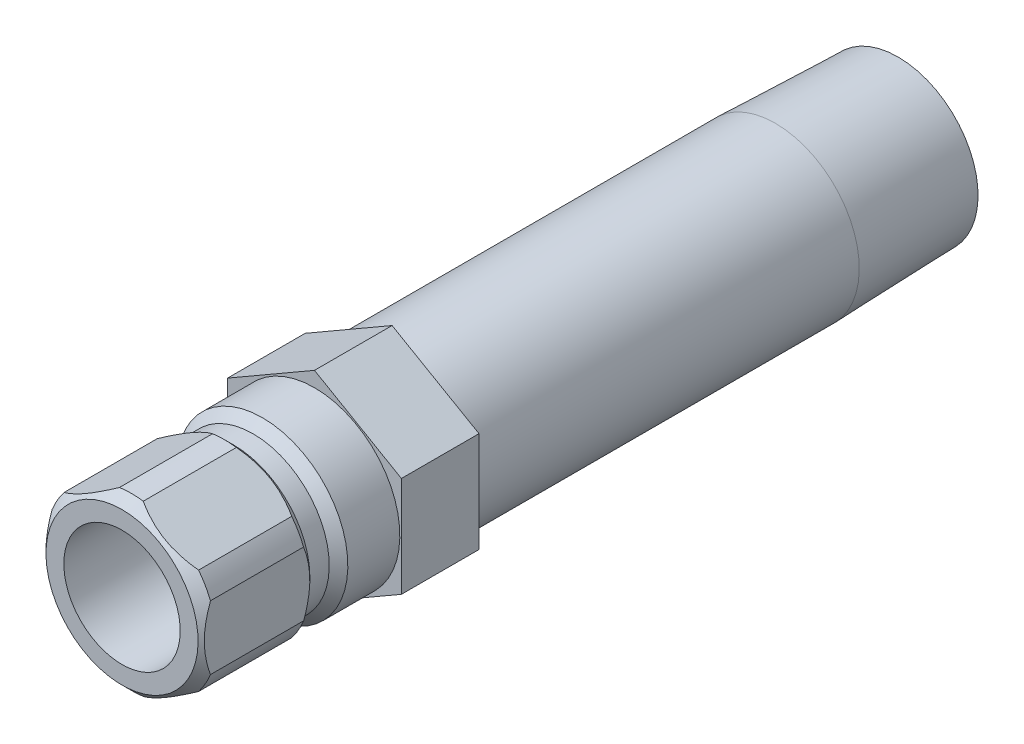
from build123d import *

# Parameters (mm, degrees)
SKETCH2_R           = 4.6228
BOSS_EXTRUDE1_DEPTH = 6.35
CUT_EXTRUDE1_START  = 6.604
SKETCH3_OUTSIDE_W   = 29.646
SKETCH3_OUTSIDE_H   = 31.846
CUT_EXTRUDE1_DEPTH  = 43.368183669


with BuildPart() as part:
    # Sketch1 → Revolve1 (revolve)
    with BuildSketch(Plane(origin=(0, 0, 0), x_dir=(0, 0, -1), z_dir=(1, 0, 0))):
        Polygon((-15.748, 4.7625), (-15.748, 6.223), (-14.986, 6.985), (-7.366, 6.985), (-6.604, 6.223), (-5.0165, 6.223), (-4.2545, 6.985), (0, 6.985), (0, 6.858), (37.719, 6.858), (47.752, 6.544470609), (47.752, 4.6228), (-3.481720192, 4.6228), (-3.556, 4.7625), align=None)
    revolve(axis=Axis((0, 0, 12.87483316), (0, 0, 1)))

    # Sketch2 → Boss-Extrude1 (add)
    with BuildSketch(Plane.XY):
        Polygon((-7.112, 4.106115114), (-7.112, -4.106115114), (0, -8.212230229), (7.112, -4.106115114), (7.112, 4.106115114), (0, 8.212230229), align=None)
        with Locations(Location((0, 0, 0), (0, 0, 90))):
            Circle(SKETCH2_R, mode=Mode.SUBTRACT)
    extrude(amount=-BOSS_EXTRUDE1_DEPTH)

    # Sketch3 outside → Cut-Extrude1 (cut, through all)
    with BuildSketch(Plane.XY.offset(CUT_EXTRUDE1_START)):
        Rectangle(SKETCH3_OUTSIDE_W, SKETCH3_OUTSIDE_H)
        Polygon((6.477, -3.739497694), (6.477, 3.739497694), (0, 7.478995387), (-6.477, 3.739497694), (-6.477, -3.739497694), (0, -7.478995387), align=None, mode=Mode.SUBTRACT)
    extrude(amount=CUT_EXTRUDE1_DEPTH, mode=Mode.SUBTRACT)


solid = part.part
